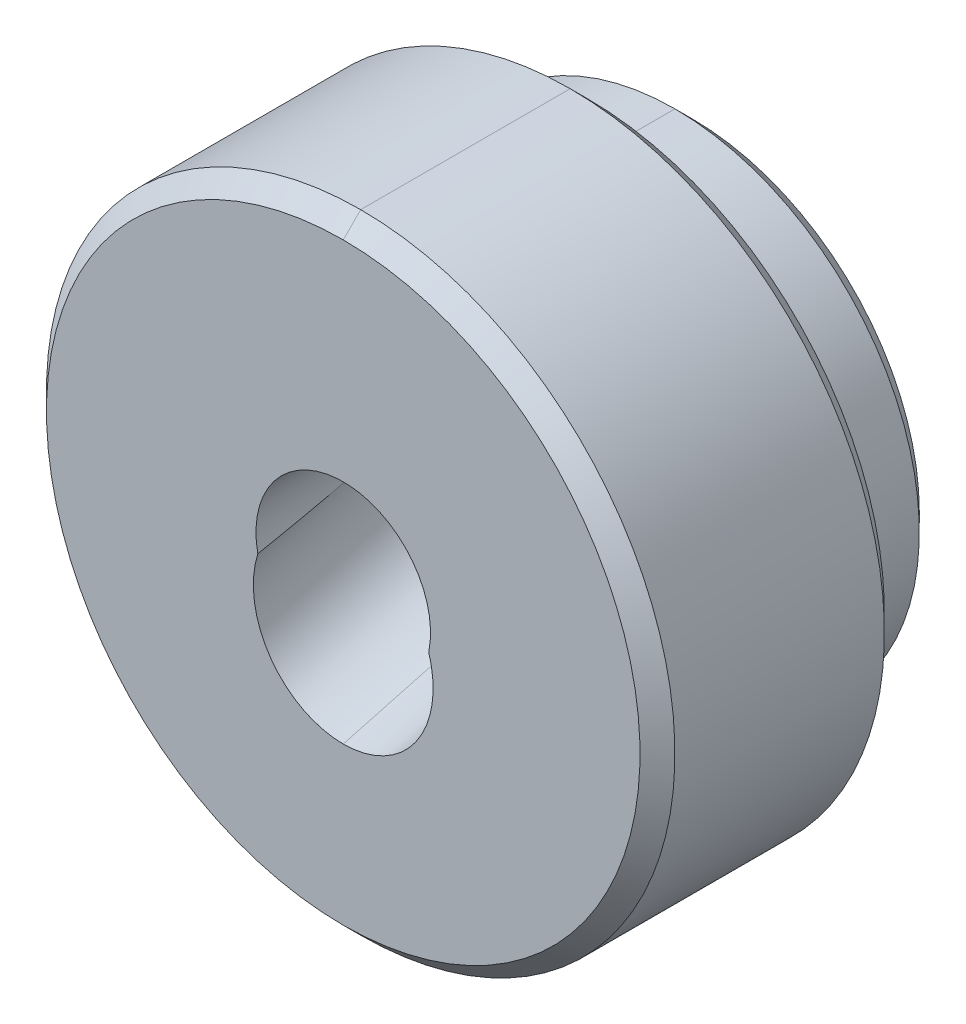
ISO-10303-21;
HEADER;
FILE_DESCRIPTION(('STEP AP214'),'2;1');
FILE_NAME('part.step','',(''),(''),'','','');
FILE_SCHEMA(('AUTOMOTIVE_DESIGN { 1 0 10303 214 1 1 1 1 }'));
ENDSEC;
DATA;
#1=APPLICATION_CONTEXT('core data for automotive mechanical design processes');
#2=APPLICATION_PROTOCOL_DEFINITION('international standard','automotive_design',2000,#1);
#3=PRODUCT_CONTEXT('',#1,'mechanical');
#4=PRODUCT('Part','Part','',(#3));
#5=PRODUCT_RELATED_PRODUCT_CATEGORY('part','',(#4));
#6=PRODUCT_DEFINITION_FORMATION('','',#4);
#7=PRODUCT_DEFINITION_CONTEXT('part definition',#1,'design');
#8=PRODUCT_DEFINITION('design','',#6,#7);
#9=PRODUCT_DEFINITION_SHAPE('','',#8);
#10=(LENGTH_UNIT() NAMED_UNIT(*) SI_UNIT(.MILLI.,.METRE.));
#11=(NAMED_UNIT(*) PLANE_ANGLE_UNIT() SI_UNIT($,.RADIAN.));
#12=(NAMED_UNIT(*) SI_UNIT($,.STERADIAN.) SOLID_ANGLE_UNIT());
#13=UNCERTAINTY_MEASURE_WITH_UNIT(LENGTH_MEASURE(1.E-05),#10,'distance_accuracy_value','');
#14=(GEOMETRIC_REPRESENTATION_CONTEXT(3) GLOBAL_UNCERTAINTY_ASSIGNED_CONTEXT((#13)) GLOBAL_UNIT_ASSIGNED_CONTEXT((#10,
#11,#12)) REPRESENTATION_CONTEXT('',''));
#15=CARTESIAN_POINT('',(0.,0.,0.));
#16=DIRECTION('',(0.,0.,1.));
#17=DIRECTION('',(1.,0.,0.));
#18=AXIS2_PLACEMENT_3D('',#15,#16,#17);
#19=CARTESIAN_POINT('',(0.,0.,5.));
#20=DIRECTION('',(0.,0.,1.));
#21=DIRECTION('',(1.,0.,0.));
#22=AXIS2_PLACEMENT_3D('',#19,#20,#21);
#23=CYLINDRICAL_SURFACE('',#22,14.);
#24=CARTESIAN_POINT('',(0.,0.,5.));
#25=DIRECTION('',(0.,0.,1.));
#26=DIRECTION('',(1.,0.,0.));
#27=AXIS2_PLACEMENT_3D('',#24,#25,#26);
#28=CIRCLE('',#27,14.);
#29=CARTESIAN_POINT('',(-14.,0.,5.));
#30=VERTEX_POINT('',#29);
#31=CARTESIAN_POINT('',(0.,-14.,5.));
#32=VERTEX_POINT('',#31);
#33=EDGE_CURVE('E409',#30,#32,#28,.T.);
#34=ORIENTED_EDGE('',*,*,#33,.F.);
#35=CARTESIAN_POINT('',(0.,0.,5.));
#36=DIRECTION('',(0.,0.,1.));
#37=DIRECTION('',(1.,0.,0.));
#38=AXIS2_PLACEMENT_3D('',#35,#36,#37);
#39=CIRCLE('',#38,14.);
#40=CARTESIAN_POINT('',(0.,14.,5.));
#41=VERTEX_POINT('',#40);
#42=EDGE_CURVE('E278',#41,#30,#39,.T.);
#43=ORIENTED_EDGE('',*,*,#42,.F.);
#44=DIRECTION('',(0.,0.,1.));
#45=VECTOR('',#44,1.);
#46=CARTESIAN_POINT('',(0.,14.,3.));
#47=LINE('',#46,#45);
#48=CARTESIAN_POINT('',(0.,14.,1.));
#49=VERTEX_POINT('',#48);
#50=EDGE_CURVE('E115',#49,#41,#47,.T.);
#51=ORIENTED_EDGE('',*,*,#50,.F.);
#52=CARTESIAN_POINT('',(0.,0.,1.));
#53=DIRECTION('',(0.,0.,-1.));
#54=DIRECTION('',(0.,1.,0.));
#55=AXIS2_PLACEMENT_3D('',#52,#53,#54);
#56=CIRCLE('',#55,14.);
#57=CARTESIAN_POINT('',(0.,-14.,1.));
#58=VERTEX_POINT('',#57);
#59=EDGE_CURVE('E184',#58,#49,#56,.T.);
#60=ORIENTED_EDGE('',*,*,#59,.F.);
#61=DIRECTION('',(0.,0.,-1.));
#62=VECTOR('',#61,1.);
#63=CARTESIAN_POINT('',(0.,-14.,3.));
#64=LINE('',#63,#62);
#65=EDGE_CURVE('E411',#32,#58,#64,.T.);
#66=ORIENTED_EDGE('',*,*,#65,.F.);
#67=EDGE_LOOP('',(#34,#43,#51,#60,#66));
#68=FACE_BOUND('',#67,.T.);
#69=ADVANCED_FACE('F14',(#68),#23,.T.);
#70=CARTESIAN_POINT('',(0.,0.,5.));
#71=DIRECTION('',(0.,0.,1.));
#72=DIRECTION('',(1.,0.,0.));
#73=AXIS2_PLACEMENT_3D('',#70,#71,#72);
#74=CYLINDRICAL_SURFACE('',#73,14.);
#75=ORIENTED_EDGE('',*,*,#65,.T.);
#76=CARTESIAN_POINT('',(0.,0.,1.));
#77=DIRECTION('',(0.,0.,-1.));
#78=DIRECTION('',(0.,1.,0.));
#79=AXIS2_PLACEMENT_3D('',#76,#77,#78);
#80=CIRCLE('',#79,14.);
#81=EDGE_CURVE('E168',#49,#58,#80,.T.);
#82=ORIENTED_EDGE('',*,*,#81,.F.);
#83=ORIENTED_EDGE('',*,*,#50,.T.);
#84=CARTESIAN_POINT('',(0.,0.,5.));
#85=DIRECTION('',(0.,0.,1.));
#86=DIRECTION('',(1.,0.,0.));
#87=AXIS2_PLACEMENT_3D('',#84,#85,#86);
#88=CIRCLE('',#87,14.);
#89=CARTESIAN_POINT('',(14.,0.,5.));
#90=VERTEX_POINT('',#89);
#91=EDGE_CURVE('E276',#90,#41,#88,.T.);
#92=ORIENTED_EDGE('',*,*,#91,.F.);
#93=CARTESIAN_POINT('',(0.,0.,5.));
#94=DIRECTION('',(0.,0.,1.));
#95=DIRECTION('',(1.,0.,0.));
#96=AXIS2_PLACEMENT_3D('',#93,#94,#95);
#97=CIRCLE('',#96,14.);
#98=EDGE_CURVE('E220',#32,#90,#97,.T.);
#99=ORIENTED_EDGE('',*,*,#98,.F.);
#100=EDGE_LOOP('',(#75,#82,#83,#92,#99));
#101=FACE_BOUND('',#100,.T.);
#102=ADVANCED_FACE('F403',(#101),#74,.T.);
#103=CARTESIAN_POINT('',(0.,0.,5.));
#104=DIRECTION('',(0.,0.,1.));
#105=DIRECTION('',(1.,0.,0.));
#106=AXIS2_PLACEMENT_3D('',#103,#104,#105);
#107=TOROIDAL_SURFACE('',#106,15.,1.);
#108=CARTESIAN_POINT('',(15.,0.,5.));
#109=DIRECTION('',(0.,-1.,0.));
#110=DIRECTION('',(-1.,0.,0.));
#111=AXIS2_PLACEMENT_3D('',#108,#109,#110);
#112=CIRCLE('',#111,1.);
#113=CARTESIAN_POINT('',(15.,0.,6.));
#114=VERTEX_POINT('',#113);
#115=EDGE_CURVE('E219',#114,#90,#112,.T.);
#116=ORIENTED_EDGE('',*,*,#115,.F.);
#117=CARTESIAN_POINT('',(0.,0.,6.));
#118=DIRECTION('',(0.,0.,-1.));
#119=DIRECTION('',(1.,0.,0.));
#120=AXIS2_PLACEMENT_3D('',#117,#118,#119);
#121=CIRCLE('',#120,15.);
#122=CARTESIAN_POINT('',(-15.,0.,6.));
#123=VERTEX_POINT('',#122);
#124=EDGE_CURVE('E156',#123,#114,#121,.F.);
#125=ORIENTED_EDGE('',*,*,#124,.F.);
#126=CARTESIAN_POINT('',(-15.,0.,5.));
#127=DIRECTION('',(0.,1.,0.));
#128=DIRECTION('',(1.,0.,0.));
#129=AXIS2_PLACEMENT_3D('',#126,#127,#128);
#130=CIRCLE('',#129,1.);
#131=EDGE_CURVE('E212',#30,#123,#130,.F.);
#132=ORIENTED_EDGE('',*,*,#131,.F.);
#133=ORIENTED_EDGE('',*,*,#33,.T.);
#134=ORIENTED_EDGE('',*,*,#98,.T.);
#135=EDGE_LOOP('',(#116,#125,#132,#133,#134));
#136=FACE_BOUND('',#135,.T.);
#137=ADVANCED_FACE('F197',(#136),#107,.F.);
#138=CARTESIAN_POINT('',(0.,0.,5.));
#139=DIRECTION('',(0.,0.,1.));
#140=DIRECTION('',(1.,0.,0.));
#141=AXIS2_PLACEMENT_3D('',#138,#139,#140);
#142=TOROIDAL_SURFACE('',#141,15.,1.);
#143=ORIENTED_EDGE('',*,*,#91,.T.);
#144=ORIENTED_EDGE('',*,*,#42,.T.);
#145=ORIENTED_EDGE('',*,*,#131,.T.);
#146=CARTESIAN_POINT('',(0.,0.,6.));
#147=DIRECTION('',(0.,0.,-1.));
#148=DIRECTION('',(-1.,0.,0.));
#149=AXIS2_PLACEMENT_3D('',#146,#147,#148);
#150=CIRCLE('',#149,15.);
#151=CARTESIAN_POINT('',(0.,15.,6.));
#152=VERTEX_POINT('',#151);
#153=EDGE_CURVE('E162',#152,#123,#150,.F.);
#154=ORIENTED_EDGE('',*,*,#153,.F.);
#155=CARTESIAN_POINT('',(0.,0.,6.));
#156=DIRECTION('',(0.,0.,-1.));
#157=DIRECTION('',(0.,1.,0.));
#158=AXIS2_PLACEMENT_3D('',#155,#156,#157);
#159=CIRCLE('',#158,15.);
#160=EDGE_CURVE('E151',#114,#152,#159,.F.);
#161=ORIENTED_EDGE('',*,*,#160,.F.);
#162=ORIENTED_EDGE('',*,*,#115,.T.);
#163=EDGE_LOOP('',(#143,#144,#145,#154,#161,#162));
#164=FACE_BOUND('',#163,.T.);
#165=ADVANCED_FACE('F191',(#164),#142,.F.);
#166=CARTESIAN_POINT('',(0.,0.,0.));
#167=DIRECTION('',(0.,0.,1.));
#168=DIRECTION('',(1.,0.,0.));
#169=AXIS2_PLACEMENT_3D('',#166,#167,#168);
#170=CONICAL_SURFACE('',#169,13.,0.785398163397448);
#171=DIRECTION('',(0.,0.707106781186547,-0.707106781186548));
#172=VECTOR('',#171,1.);
#173=CARTESIAN_POINT('',(0.,-9.89949493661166,-3.10050506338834));
#174=LINE('',#173,#172);
#175=CARTESIAN_POINT('',(0.,-13.,0.));
#176=VERTEX_POINT('',#175);
#177=EDGE_CURVE('E165',#58,#176,#174,.T.);
#178=ORIENTED_EDGE('',*,*,#177,.F.);
#179=ORIENTED_EDGE('',*,*,#59,.T.);
#180=DIRECTION('',(0.,0.707106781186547,0.707106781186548));
#181=VECTOR('',#180,1.);
#182=CARTESIAN_POINT('',(0.,9.89949493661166,-3.10050506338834));
#183=LINE('',#182,#181);
#184=CARTESIAN_POINT('',(0.,13.,0.));
#185=VERTEX_POINT('',#184);
#186=EDGE_CURVE('E174',#185,#49,#183,.T.);
#187=ORIENTED_EDGE('',*,*,#186,.F.);
#188=CARTESIAN_POINT('',(0.,0.,0.));
#189=DIRECTION('',(0.,0.,1.));
#190=DIRECTION('',(1.,0.,0.));
#191=AXIS2_PLACEMENT_3D('',#188,#189,#190);
#192=CIRCLE('',#191,13.);
#193=EDGE_CURVE('E148',#176,#185,#192,.F.);
#194=ORIENTED_EDGE('',*,*,#193,.F.);
#195=EDGE_LOOP('',(#178,#179,#187,#194));
#196=FACE_BOUND('',#195,.T.);
#197=ADVANCED_FACE('F196',(#196),#170,.T.);
#198=CARTESIAN_POINT('',(0.,0.,0.));
#199=DIRECTION('',(0.,0.,1.));
#200=DIRECTION('',(1.,0.,0.));
#201=AXIS2_PLACEMENT_3D('',#198,#199,#200);
#202=CONICAL_SURFACE('',#201,13.,0.785398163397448);
#203=ORIENTED_EDGE('',*,*,#177,.T.);
#204=CARTESIAN_POINT('',(0.,0.,0.));
#205=DIRECTION('',(0.,0.,1.));
#206=DIRECTION('',(1.,0.,0.));
#207=AXIS2_PLACEMENT_3D('',#204,#205,#206);
#208=CIRCLE('',#207,13.);
#209=EDGE_CURVE('E145',#185,#176,#208,.F.);
#210=ORIENTED_EDGE('',*,*,#209,.F.);
#211=ORIENTED_EDGE('',*,*,#186,.T.);
#212=ORIENTED_EDGE('',*,*,#81,.T.);
#213=EDGE_LOOP('',(#203,#210,#211,#212));
#214=FACE_BOUND('',#213,.T.);
#215=ADVANCED_FACE('F238',(#214),#202,.T.);
#216=CARTESIAN_POINT('',(17.2040021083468,17.,6.));
#217=DIRECTION('',(0.,0.,-1.));
#218=DIRECTION('',(0.,-1.,0.));
#219=AXIS2_PLACEMENT_3D('',#216,#217,#218);
#220=PLANE('',#219);
#221=ORIENTED_EDGE('',*,*,#124,.T.);
#222=ORIENTED_EDGE('',*,*,#160,.T.);
#223=ORIENTED_EDGE('',*,*,#153,.T.);
#224=EDGE_LOOP('',(#221,#222,#223));
#225=FACE_BOUND('',#224,.T.);
#226=CARTESIAN_POINT('',(0.,0.,6.));
#227=DIRECTION('',(0.,0.,1.));
#228=DIRECTION('',(1.,0.,0.));
#229=AXIS2_PLACEMENT_3D('',#226,#227,#228);
#230=CIRCLE('',#229,17.);
#231=CARTESIAN_POINT('',(0.,17.,6.));
#232=VERTEX_POINT('',#231);
#233=CARTESIAN_POINT('',(0.,-17.,6.));
#234=VERTEX_POINT('',#233);
#235=EDGE_CURVE('E140',#232,#234,#230,.T.);
#236=ORIENTED_EDGE('',*,*,#235,.F.);
#237=CARTESIAN_POINT('',(0.,0.,6.));
#238=DIRECTION('',(0.,0.,1.));
#239=DIRECTION('',(1.,0.,0.));
#240=AXIS2_PLACEMENT_3D('',#237,#238,#239);
#241=CIRCLE('',#240,17.);
#242=EDGE_CURVE('E150',#234,#232,#241,.T.);
#243=ORIENTED_EDGE('',*,*,#242,.F.);
#244=EDGE_LOOP('',(#236,#243));
#245=FACE_BOUND('',#244,.T.);
#246=ADVANCED_FACE('F228',(#225,#245),#220,.T.);
#247=CARTESIAN_POINT('',(0.,0.,6.));
#248=DIRECTION('',(0.,0.,1.));
#249=DIRECTION('',(1.,0.,0.));
#250=AXIS2_PLACEMENT_3D('',#247,#248,#249);
#251=CONICAL_SURFACE('',#250,17.,0.785398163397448);
#252=DIRECTION('',(0.,-0.707106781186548,0.707106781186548));
#253=VECTOR('',#252,1.);
#254=CARTESIAN_POINT('',(0.,-12.7279220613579,1.72792206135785));
#255=LINE('',#254,#253);
#256=CARTESIAN_POINT('',(0.,-18.,7.));
#257=VERTEX_POINT('',#256);
#258=EDGE_CURVE('E143',#234,#257,#255,.T.);
#259=ORIENTED_EDGE('',*,*,#258,.F.);
#260=ORIENTED_EDGE('',*,*,#242,.T.);
#261=DIRECTION('',(0.,-0.707106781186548,-0.707106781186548));
#262=VECTOR('',#261,1.);
#263=CARTESIAN_POINT('',(0.,12.7279220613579,1.72792206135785));
#264=LINE('',#263,#262);
#265=CARTESIAN_POINT('',(0.,18.,7.));
#266=VERTEX_POINT('',#265);
#267=EDGE_CURVE('E144',#266,#232,#264,.T.);
#268=ORIENTED_EDGE('',*,*,#267,.F.);
#269=CARTESIAN_POINT('',(0.,0.,7.));
#270=DIRECTION('',(0.,0.,1.));
#271=DIRECTION('',(0.,1.,0.));
#272=AXIS2_PLACEMENT_3D('',#269,#270,#271);
#273=CIRCLE('',#272,18.);
#274=EDGE_CURVE('E327',#257,#266,#273,.T.);
#275=ORIENTED_EDGE('',*,*,#274,.F.);
#276=EDGE_LOOP('',(#259,#260,#268,#275));
#277=FACE_BOUND('',#276,.T.);
#278=ADVANCED_FACE('F237',(#277),#251,.T.);
#279=CARTESIAN_POINT('',(13.1560021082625,13.,0.));
#280=DIRECTION('',(0.,0.,-1.));
#281=DIRECTION('',(0.,-1.,0.));
#282=AXIS2_PLACEMENT_3D('',#279,#280,#281);
#283=PLANE('',#282);
#284=CARTESIAN_POINT('',(0.,0.,0.));
#285=DIRECTION('',(0.,0.,-1.));
#286=DIRECTION('',(-1.,0.,0.));
#287=AXIS2_PLACEMENT_3D('',#284,#285,#286);
#288=CIRCLE('',#287,5.);
#289=CARTESIAN_POINT('',(4.89458911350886,1.02127244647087,0.));
#290=VERTEX_POINT('',#289);
#291=CARTESIAN_POINT('',(-4.89458911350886,1.02127244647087,0.));
#292=VERTEX_POINT('',#291);
#293=EDGE_CURVE('E28',#290,#292,#288,.T.);
#294=ORIENTED_EDGE('',*,*,#293,.F.);
#295=CARTESIAN_POINT('',(0.,2.67949192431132,0.));
#296=DIRECTION('',(0.,0.,-1.));
#297=DIRECTION('',(0.,-1.,0.));
#298=AXIS2_PLACEMENT_3D('',#295,#296,#297);
#299=ELLIPSE('',#298,5.33167232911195,5.15);
#300=CARTESIAN_POINT('',(0.,8.01116425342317,0.));
#301=VERTEX_POINT('',#300);
#302=EDGE_CURVE('E122',#301,#290,#299,.T.);
#303=ORIENTED_EDGE('',*,*,#302,.F.);
#304=CARTESIAN_POINT('',(0.,2.67949192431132,0.));
#305=DIRECTION('',(0.,0.,-1.));
#306=DIRECTION('',(0.,-1.,0.));
#307=AXIS2_PLACEMENT_3D('',#304,#305,#306);
#308=ELLIPSE('',#307,5.33167232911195,5.15);
#309=EDGE_CURVE('E124',#292,#301,#308,.T.);
#310=ORIENTED_EDGE('',*,*,#309,.F.);
#311=EDGE_LOOP('',(#294,#303,#310));
#312=FACE_BOUND('',#311,.T.);
#313=ORIENTED_EDGE('',*,*,#193,.T.);
#314=ORIENTED_EDGE('',*,*,#209,.T.);
#315=EDGE_LOOP('',(#313,#314));
#316=FACE_BOUND('',#315,.T.);
#317=ADVANCED_FACE('F120',(#312,#316),#283,.T.);
#318=CARTESIAN_POINT('',(0.,0.,6.));
#319=DIRECTION('',(0.,0.,1.));
#320=DIRECTION('',(1.,0.,0.));
#321=AXIS2_PLACEMENT_3D('',#318,#319,#320);
#322=CONICAL_SURFACE('',#321,17.,0.785398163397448);
#323=ORIENTED_EDGE('',*,*,#258,.T.);
#324=CARTESIAN_POINT('',(0.,0.,7.));
#325=DIRECTION('',(0.,0.,1.));
#326=DIRECTION('',(0.,1.,0.));
#327=AXIS2_PLACEMENT_3D('',#324,#325,#326);
#328=CIRCLE('',#327,18.);
#329=EDGE_CURVE('E303',#266,#257,#328,.T.);
#330=ORIENTED_EDGE('',*,*,#329,.F.);
#331=ORIENTED_EDGE('',*,*,#267,.T.);
#332=ORIENTED_EDGE('',*,*,#235,.T.);
#333=EDGE_LOOP('',(#323,#330,#331,#332));
#334=FACE_BOUND('',#333,.T.);
#335=ADVANCED_FACE('F429',(#334),#322,.T.);
#336=CARTESIAN_POINT('',(0.,0.,19.));
#337=DIRECTION('',(0.,0.,1.));
#338=DIRECTION('',(1.,0.,0.));
#339=AXIS2_PLACEMENT_3D('',#336,#337,#338);
#340=CYLINDRICAL_SURFACE('',#339,18.);
#341=DIRECTION('',(0.,0.,1.));
#342=VECTOR('',#341,1.);
#343=CARTESIAN_POINT('',(0.,-18.,13.));
#344=LINE('',#343,#342);
#345=CARTESIAN_POINT('',(0.,-18.,19.));
#346=VERTEX_POINT('',#345);
#347=EDGE_CURVE('E298',#257,#346,#344,.T.);
#348=ORIENTED_EDGE('',*,*,#347,.F.);
#349=ORIENTED_EDGE('',*,*,#274,.T.);
#350=DIRECTION('',(0.,0.,-1.));
#351=VECTOR('',#350,1.);
#352=CARTESIAN_POINT('',(0.,18.,13.));
#353=LINE('',#352,#351);
#354=CARTESIAN_POINT('',(0.,18.,19.));
#355=VERTEX_POINT('',#354);
#356=EDGE_CURVE('E310',#355,#266,#353,.T.);
#357=ORIENTED_EDGE('',*,*,#356,.F.);
#358=CARTESIAN_POINT('',(0.,0.,19.));
#359=DIRECTION('',(0.,0.,1.));
#360=DIRECTION('',(0.,1.,0.));
#361=AXIS2_PLACEMENT_3D('',#358,#359,#360);
#362=CIRCLE('',#361,18.);
#363=EDGE_CURVE('E130',#346,#355,#362,.T.);
#364=ORIENTED_EDGE('',*,*,#363,.F.);
#365=EDGE_LOOP('',(#348,#349,#357,#364));
#366=FACE_BOUND('',#365,.T.);
#367=ADVANCED_FACE('F349',(#366),#340,.T.);
#368=CARTESIAN_POINT('',(0.,0.,20.));
#369=DIRECTION('',(0.,0.,-1.));
#370=DIRECTION('',(-1.,0.,0.));
#371=AXIS2_PLACEMENT_3D('',#368,#369,#370);
#372=CONICAL_SURFACE('',#371,17.,0.785398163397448);
#373=DIRECTION('',(0.,-0.707106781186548,-0.707106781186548));
#374=VECTOR('',#373,1.);
#375=CARTESIAN_POINT('',(0.,-12.7279220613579,24.2720779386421));
#376=LINE('',#375,#374);
#377=CARTESIAN_POINT('',(0.,-17.,20.));
#378=VERTEX_POINT('',#377);
#379=EDGE_CURVE('E135',#378,#346,#376,.T.);
#380=ORIENTED_EDGE('',*,*,#379,.T.);
#381=ORIENTED_EDGE('',*,*,#363,.T.);
#382=DIRECTION('',(0.,-0.707106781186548,0.707106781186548));
#383=VECTOR('',#382,1.);
#384=CARTESIAN_POINT('',(0.,12.7279220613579,24.2720779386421));
#385=LINE('',#384,#383);
#386=CARTESIAN_POINT('',(0.,17.,20.));
#387=VERTEX_POINT('',#386);
#388=EDGE_CURVE('E330',#355,#387,#385,.T.);
#389=ORIENTED_EDGE('',*,*,#388,.T.);
#390=CARTESIAN_POINT('',(0.,0.,20.));
#391=DIRECTION('',(0.,0.,-1.));
#392=DIRECTION('',(-1.,0.,0.));
#393=AXIS2_PLACEMENT_3D('',#390,#391,#392);
#394=CIRCLE('',#393,17.);
#395=EDGE_CURVE('E296',#378,#387,#394,.F.);
#396=ORIENTED_EDGE('',*,*,#395,.F.);
#397=EDGE_LOOP('',(#380,#381,#389,#396));
#398=FACE_BOUND('',#397,.T.);
#399=ADVANCED_FACE('F350',(#398),#372,.T.);
#400=CARTESIAN_POINT('',(0.,3.03672654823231,-1.33321776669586));
#401=DIRECTION('',(0.,-0.25881904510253,0.965925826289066));
#402=DIRECTION('',(0.,-0.965925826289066,-0.25881904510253));
#403=AXIS2_PLACEMENT_3D('',#400,#401,#402);
#404=CYLINDRICAL_SURFACE('',#403,5.15);
#405=CARTESIAN_POINT('',(0.,5.,11.2378179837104));
#406=CARTESIAN_POINT('',(0.140627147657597,5.0000151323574,11.2378283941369));
#407=CARTESIAN_POINT('',(0.281252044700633,4.99406783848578,11.2377050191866));
#408=CARTESIAN_POINT('',(0.561495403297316,4.97035772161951,11.2372645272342));
#409=CARTESIAN_POINT('',(0.701113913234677,4.95259547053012,11.2369474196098));
#410=CARTESIAN_POINT('',(0.978185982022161,4.90539376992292,11.2361937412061));
#411=CARTESIAN_POINT('',(1.11564199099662,4.87596870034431,11.2357573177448));
#412=CARTESIAN_POINT('',(1.38758785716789,4.80565514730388,11.2349171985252));
#413=CARTESIAN_POINT('',(1.52207775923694,4.76476683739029,11.2345135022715));
#414=CARTESIAN_POINT('',(1.78718507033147,4.67179925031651,11.2339605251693));
#415=CARTESIAN_POINT('',(1.91780113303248,4.61971613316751,11.2338113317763));
#416=CARTESIAN_POINT('',(2.17418689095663,4.50473639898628,11.2340812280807));
#417=CARTESIAN_POINT('',(2.29995648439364,4.44183955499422,11.2345003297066));
#418=CARTESIAN_POINT('',(2.54584455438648,4.30562935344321,11.2363374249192));
#419=CARTESIAN_POINT('',(2.66595855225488,4.23230791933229,11.2377561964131));
#420=CARTESIAN_POINT('',(2.89955704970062,4.07582280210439,11.2421813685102));
#421=CARTESIAN_POINT('',(3.0130419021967,3.9926596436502,11.2451876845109));
#422=CARTESIAN_POINT('',(3.23239473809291,3.81723928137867,11.2535891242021));
#423=CARTESIAN_POINT('',(3.33827346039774,3.72499535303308,11.2589807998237));
#424=CARTESIAN_POINT('',(3.54177398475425,3.53206652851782,11.2732674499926));
#425=CARTESIAN_POINT('',(3.63939662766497,3.4313824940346,11.2821620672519));
#426=CARTESIAN_POINT('',(3.82549117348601,3.22259753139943,11.3050155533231));
#427=CARTESIAN_POINT('',(3.91397376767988,3.11450552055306,11.3189684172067));
#428=CARTESIAN_POINT('',(4.08103191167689,2.89214780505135,11.3541453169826));
#429=CARTESIAN_POINT('',(4.15961493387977,2.7778868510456,11.3753638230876));
#430=CARTESIAN_POINT('',(4.31413676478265,2.53207884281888,11.431101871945));
#431=CARTESIAN_POINT('',(4.38885153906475,2.40000597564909,11.4668200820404));
#432=CARTESIAN_POINT('',(4.4900149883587,2.20121027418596,11.5340931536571));
#433=CARTESIAN_POINT('',(4.52189546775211,2.13488749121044,11.5587732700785));
#434=CARTESIAN_POINT('',(4.58195777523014,2.00272729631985,11.613450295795));
#435=CARTESIAN_POINT('',(4.61013956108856,1.93688988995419,11.6434472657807));
#436=CARTESIAN_POINT('',(4.66311198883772,1.80567699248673,11.7098770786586));
#437=CARTESIAN_POINT('',(4.68784494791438,1.74032351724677,11.7464003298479));
#438=CARTESIAN_POINT('',(4.73342454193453,1.61223986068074,11.8258476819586));
#439=CARTESIAN_POINT('',(4.75427188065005,1.54950920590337,11.8687706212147));
#440=CARTESIAN_POINT('',(4.81116454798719,1.36707094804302,12.0070810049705));
#441=CARTESIAN_POINT('',(4.84169663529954,1.25276549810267,12.1121810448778));
#442=CARTESIAN_POINT('',(4.88015337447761,1.08984036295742,12.2912025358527));
#443=CARTESIAN_POINT('',(4.89211205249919,1.03446673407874,12.3584631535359));
#444=CARTESIAN_POINT('',(4.91314540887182,0.929439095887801,12.4977769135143));
#445=CARTESIAN_POINT('',(4.9222192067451,0.879786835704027,12.5698315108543));
#446=CARTESIAN_POINT('',(4.93814629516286,0.785503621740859,12.7178949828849));
#447=CARTESIAN_POINT('',(4.94498721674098,0.740901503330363,12.7939232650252));
#448=CARTESIAN_POINT('',(4.95692119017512,0.656313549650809,12.9485943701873));
#449=CARTESIAN_POINT('',(4.96201455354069,0.616326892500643,13.0272367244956));
#450=CARTESIAN_POINT('',(4.97382171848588,0.514969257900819,13.2392918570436));
#451=CARTESIAN_POINT('',(4.97936599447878,0.457028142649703,13.3744005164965));
#452=CARTESIAN_POINT('',(4.98809277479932,0.349052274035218,13.6478492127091));
#453=CARTESIAN_POINT('',(4.99127338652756,0.299023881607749,13.7861917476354));
#454=CARTESIAN_POINT('',(4.99602971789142,0.204738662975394,14.0651943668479));
#455=CARTESIAN_POINT('',(4.99760167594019,0.160495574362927,14.2058591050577));
#456=CARTESIAN_POINT('',(4.99959083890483,0.0764470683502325,14.4885255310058));
#457=CARTESIAN_POINT('',(5.00000783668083,0.0366424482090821,14.6305274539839));
#458=CARTESIAN_POINT('',(4.99998354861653,-0.0782931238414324,15.0598756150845));
#459=CARTESIAN_POINT('',(4.9982430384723,-0.148313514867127,15.3485810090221));
#460=CARTESIAN_POINT('',(4.99257936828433,-0.280017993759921,15.92734964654));
#461=CARTESIAN_POINT('',(4.98865944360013,-0.341714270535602,16.2174102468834));
#462=CARTESIAN_POINT('',(4.97835022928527,-0.469967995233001,16.8490796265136));
#463=CARTESIAN_POINT('',(4.97165023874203,-0.535507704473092,17.1908887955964));
#464=CARTESIAN_POINT('',(4.95640912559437,-0.661838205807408,17.8755151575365));
#465=CARTESIAN_POINT('',(4.94786703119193,-0.722626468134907,18.2183327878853));
#466=CARTESIAN_POINT('',(4.92933264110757,-0.839720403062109,18.8974335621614));
#467=CARTESIAN_POINT('',(4.91937375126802,-0.896092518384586,19.2337062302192));
#468=CARTESIAN_POINT('',(4.89796648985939,-1.00649273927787,19.906370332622));
#469=CARTESIAN_POINT('',(4.88651906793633,-1.06052231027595,20.2427615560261));
#470=CARTESIAN_POINT('',(4.87436413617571,-1.11381069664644,20.5792380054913));
#471=B_SPLINE_CURVE_WITH_KNOTS('',3,(#405,#406,#407,#408,#409,#410,#411,#412,#413,#414,#415,
#416,#417,#418,#419,#420,#421,#422,#423,#424,#425,#426,#427,#428,#429,#430,#431,#432,#433,#434,
#435,#436,#437,#438,#439,#440,#441,#442,#443,#444,#445,#446,#447,#448,#449,#450,#451,#452,#453,
#454,#455,#456,#457,#458,#459,#460,#461,#462,#463,#464,#465,#466,#467,#468,#469,#470),
.UNSPECIFIED.,.F.,.F.,(4,2,2,2,2,2,2,2,2,2,2,2,2,2,2,2,2,2,2,2,2,2,2,2,2,2,2,2,2,2,2,2,4),(0.,
0.421752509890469,0.843484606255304,1.2646983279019,1.68590567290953,2.10725772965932,
2.52861863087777,2.95030778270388,3.37197446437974,3.79303360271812,4.21404980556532,
4.63456782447,5.05476650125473,5.52081292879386,5.75343971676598,5.98606916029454,
6.22221409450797,6.45831621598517,6.92930271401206,7.19280920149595,7.45639603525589,
7.72141915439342,7.98639500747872,8.42730725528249,8.86857216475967,9.31086656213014,
9.7532402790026,10.6442248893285,11.5338903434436,12.5781252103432,13.6229123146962,
14.6462308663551,15.6688997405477),.UNSPECIFIED.);
#472=CARTESIAN_POINT('',(0.,5.,11.2378179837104));
#473=VERTEX_POINT('',#472);
#474=CARTESIAN_POINT('',(4.89458911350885,-1.02127244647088,20.));
#475=VERTEX_POINT('',#474);
#476=EDGE_CURVE('E35',#473,#475,#471,.T.);
#477=ORIENTED_EDGE('',*,*,#476,.F.);
#478=DIRECTION('',(0.,-0.258819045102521,0.965925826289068));
#479=VECTOR('',#478,1.);
#480=CARTESIAN_POINT('',(0.,4.9745180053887,11.332918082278));
#481=LINE('',#480,#479);
#482=EDGE_CURVE('E129',#301,#473,#481,.T.);
#483=ORIENTED_EDGE('',*,*,#482,.F.);
#484=ORIENTED_EDGE('',*,*,#302,.T.);
#485=CARTESIAN_POINT('',(0.,-5.,8.76218201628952));
#486=CARTESIAN_POINT('',(0.140627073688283,-5.00001513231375,8.76217160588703));
#487=CARTESIAN_POINT('',(0.281251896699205,-4.99406784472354,8.76229498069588));
#488=CARTESIAN_POINT('',(0.561495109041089,-4.97035775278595,8.7627354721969));
#489=CARTESIAN_POINT('',(0.701113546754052,-4.95259552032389,8.76305257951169));
#490=CARTESIAN_POINT('',(0.978185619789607,-4.90539384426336,8.76380625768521));
#491=CARTESIAN_POINT('',(1.11564170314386,-4.87596876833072,8.76424268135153));
#492=CARTESIAN_POINT('',(1.3875877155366,-4.8056551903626,8.76508280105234));
#493=CARTESIAN_POINT('',(1.52207768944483,-4.76476686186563,8.76548649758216));
#494=CARTESIAN_POINT('',(1.78718518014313,-4.67179921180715,8.76603947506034));
#495=CARTESIAN_POINT('',(1.91780134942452,-4.6197160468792,8.76618866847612));
#496=CARTESIAN_POINT('',(2.17418731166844,-4.50473619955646,8.76591877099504));
#497=CARTESIAN_POINT('',(2.29995700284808,-4.44183929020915,8.76549966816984));
#498=CARTESIAN_POINT('',(2.54584505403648,-4.30562905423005,8.76366256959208));
#499=CARTESIAN_POINT('',(2.6659589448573,-4.23230766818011,8.76224379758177));
#500=CARTESIAN_POINT('',(2.89955723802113,-4.07582266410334,8.75781862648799));
#501=CARTESIAN_POINT('',(3.01304199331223,-3.99265957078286,8.7548123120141));
#502=CARTESIAN_POINT('',(3.23239441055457,-3.81723954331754,8.74641088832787));
#503=CARTESIAN_POINT('',(3.33827282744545,-3.72499590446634,8.74101923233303));
#504=CARTESIAN_POINT('',(3.54177279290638,-3.53206770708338,8.72673264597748));
#505=CARTESIAN_POINT('',(3.63939518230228,-3.43138401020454,8.71783807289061));
#506=CARTESIAN_POINT('',(3.82548983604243,-3.22259913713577,8.69498464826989));
#507=CARTESIAN_POINT('',(3.91397273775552,-3.1145068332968,8.68103177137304));
#508=CARTESIAN_POINT('',(4.08103144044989,-2.8921484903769,8.64585481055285));
#509=CARTESIAN_POINT('',(4.15961471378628,-2.77788720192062,8.62463625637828));
#510=CARTESIAN_POINT('',(4.31413746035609,-2.53207773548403,8.56889787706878));
#511=CARTESIAN_POINT('',(4.38885281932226,-2.40000370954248,8.53317930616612));
#512=CARTESIAN_POINT('',(4.49001637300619,-2.20120742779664,8.46590580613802));
#513=CARTESIAN_POINT('',(4.52189653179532,-2.1348852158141,8.44122583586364));
#514=CARTESIAN_POINT('',(4.58195825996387,-2.00272616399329,8.38654918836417));
#515=CARTESIAN_POINT('',(4.61013978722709,-1.93688932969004,8.35655245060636));
#516=CARTESIAN_POINT('',(4.66311145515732,-1.80567831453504,8.29012359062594));
#517=CARTESIAN_POINT('',(4.68784395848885,-1.7403261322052,8.25360113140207));
#518=CARTESIAN_POINT('',(4.73342279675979,-1.61224493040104,8.17415562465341));
#519=CARTESIAN_POINT('',(4.75426983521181,-1.54951543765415,8.13123373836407));
#520=CARTESIAN_POINT('',(4.81116331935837,-1.36707553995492,7.99292318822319));
#521=CARTESIAN_POINT('',(4.84169614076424,-1.25276758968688,7.88782124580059));
#522=CARTESIAN_POINT('',(4.88015368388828,-1.08983905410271,7.70879603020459));
#523=CARTESIAN_POINT('',(4.89211258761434,-1.03446425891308,7.64153384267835));
#524=CARTESIAN_POINT('',(4.91314628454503,-0.929434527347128,7.50221674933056));
#525=CARTESIAN_POINT('',(4.92222019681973,-0.879781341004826,7.4301603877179));
#526=CARTESIAN_POINT('',(4.93814708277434,-0.785498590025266,7.28209658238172));
#527=CARTESIAN_POINT('',(4.94498778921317,-0.740897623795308,7.20606989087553));
#528=CARTESIAN_POINT('',(4.95692141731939,-0.656311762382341,7.05140211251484));
#529=CARTESIAN_POINT('',(4.96201465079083,-0.616326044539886,6.97276149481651));
#530=CARTESIAN_POINT('',(4.97382328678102,-0.514955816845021,6.76068003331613));
#531=CARTESIAN_POINT('',(4.97936836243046,-0.457003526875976,6.62554214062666));
#532=CARTESIAN_POINT('',(4.98809596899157,-0.349008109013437,6.35203394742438));
#533=CARTESIAN_POINT('',(4.9912766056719,-0.298971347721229,6.21366114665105));
#534=CARTESIAN_POINT('',(4.99603254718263,-0.204671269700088,5.93459783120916));
#535=CARTESIAN_POINT('',(4.9976040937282,-0.160421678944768,5.79390266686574));
#536=CARTESIAN_POINT('',(4.99959220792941,-0.0763611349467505,5.51117520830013));
#537=CARTESIAN_POINT('',(5.00000856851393,-0.0365509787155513,5.36914267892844));
#538=CARTESIAN_POINT('',(4.99998199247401,0.0783665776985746,4.93982580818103));
#539=CARTESIAN_POINT('',(4.99824093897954,0.148367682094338,4.65118361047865));
#540=CARTESIAN_POINT('',(4.99257805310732,0.280043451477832,4.07253594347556));
#541=CARTESIAN_POINT('',(4.98865940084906,0.341730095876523,3.78253307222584));
#542=CARTESIAN_POINT('',(4.97914621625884,0.460049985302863,3.19974671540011));
#543=CARTESIAN_POINT('',(4.97354191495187,0.516651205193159,2.90695692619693));
#544=CARTESIAN_POINT('',(4.96094569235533,0.626133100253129,2.32057697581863));
#545=CARTESIAN_POINT('',(4.95395311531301,0.679012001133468,2.02698650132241));
#546=CARTESIAN_POINT('',(4.93886374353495,0.781184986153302,1.44457183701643));
#547=CARTESIAN_POINT('',(4.9307886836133,0.830525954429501,1.15575526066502));
#548=CARTESIAN_POINT('',(4.91351503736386,0.927223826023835,0.577987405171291));
#549=CARTESIAN_POINT('',(4.90431707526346,0.974581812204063,0.289036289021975));
#550=CARTESIAN_POINT('',(4.89458911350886,1.02127244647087,0.));
#551=B_SPLINE_CURVE_WITH_KNOTS('',3,(#485,#486,#487,#488,#489,#490,#491,#492,#493,#494,#495,
#496,#497,#498,#499,#500,#501,#502,#503,#504,#505,#506,#507,#508,#509,#510,#511,#512,#513,#514,
#515,#516,#517,#518,#519,#520,#521,#522,#523,#524,#525,#526,#527,#528,#529,#530,#531,#532,#533,
#534,#535,#536,#537,#538,#539,#540,#541,#542,#543,#544,#545,#546,#547,#548,#549,#550),
.UNSPECIFIED.,.F.,.F.,(4,2,2,2,2,2,2,2,2,2,2,2,2,2,2,2,2,2,2,2,2,2,2,2,2,2,2,2,2,2,2,2,4),(0.,
0.421752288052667,0.843484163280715,1.26469810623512,1.68590567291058,2.10725807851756,
2.52861932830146,2.95030813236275,3.37197446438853,3.79303234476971,4.21404729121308,
4.63456656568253,5.05476650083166,5.52081691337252,5.75344170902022,5.98606915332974,
6.2222093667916,6.45830678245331,6.92930267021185,7.19281503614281,7.45640778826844,
7.7214250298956,7.98639495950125,8.42740078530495,8.86875953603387,9.31114681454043,
9.75361338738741,10.6444005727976,11.533890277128,12.4286376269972,13.3238086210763,
14.2031354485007,15.081975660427),.UNSPECIFIED.);
#552=CARTESIAN_POINT('',(0.,-5.,8.76218201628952));
#553=VERTEX_POINT('',#552);
#554=EDGE_CURVE('E108',#553,#290,#551,.T.);
#555=ORIENTED_EDGE('',*,*,#554,.F.);
#556=DIRECTION('',(0.,0.258819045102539,-0.965925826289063));
#557=VECTOR('',#556,1.);
#558=CARTESIAN_POINT('',(0.,-4.9745180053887,8.66708191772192));
#559=LINE('',#558,#557);
#560=CARTESIAN_POINT('',(0.,-8.01116425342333,20.));
#561=VERTEX_POINT('',#560);
#562=EDGE_CURVE('E132',#561,#553,#559,.T.);
#563=ORIENTED_EDGE('',*,*,#562,.F.);
#564=CARTESIAN_POINT('',(0.,-2.67949192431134,20.));
#565=DIRECTION('',(0.,0.,1.));
#566=DIRECTION('',(0.,-1.,0.));
#567=AXIS2_PLACEMENT_3D('',#564,#565,#566);
#568=ELLIPSE('',#567,5.33167232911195,5.15);
#569=EDGE_CURVE('E295',#475,#561,#568,.F.);
#570=ORIENTED_EDGE('',*,*,#569,.F.);
#571=EDGE_LOOP('',(#477,#483,#484,#555,#563,#570));
#572=FACE_BOUND('',#571,.T.);
#573=ADVANCED_FACE('F127',(#572),#404,.F.);
#574=CARTESIAN_POINT('',(0.,3.03672654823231,-1.33321776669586));
#575=DIRECTION('',(0.,-0.25881904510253,0.965925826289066));
#576=DIRECTION('',(0.,-0.965925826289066,-0.25881904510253));
#577=AXIS2_PLACEMENT_3D('',#574,#575,#576);
#578=CYLINDRICAL_SURFACE('',#577,5.15);
#579=CARTESIAN_POINT('',(-4.87436413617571,-1.11381069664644,20.5792380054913));
#580=CARTESIAN_POINT('',(-4.88177242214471,-1.08138249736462,20.3742878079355));
#581=CARTESIAN_POINT('',(-4.888913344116,-1.04864996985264,20.1693757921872));
#582=CARTESIAN_POINT('',(-4.9026496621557,-0.982431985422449,19.7596516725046));
#583=CARTESIAN_POINT('',(-4.9092450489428,-0.948946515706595,19.5548395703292));
#584=CARTESIAN_POINT('',(-4.92820430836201,-0.847103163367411,18.940340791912));
#585=CARTESIAN_POINT('',(-4.93973191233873,-0.777398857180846,18.5308500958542));
#586=CARTESIAN_POINT('',(-4.96043947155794,-0.632071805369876,17.7097678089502));
#587=CARTESIAN_POINT('',(-4.96960174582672,-0.556409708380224,17.2981825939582));
#588=CARTESIAN_POINT('',(-4.98110232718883,-0.436140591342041,16.6821369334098));
#589=CARTESIAN_POINT('',(-4.98456174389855,-0.394927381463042,16.4770371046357));
#590=CARTESIAN_POINT('',(-4.99059838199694,-0.309473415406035,16.0674586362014));
#591=CARTESIAN_POINT('',(-4.99317563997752,-0.265232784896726,15.862979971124));
#592=CARTESIAN_POINT('',(-4.99685195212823,-0.181338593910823,15.4932657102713));
#593=CARTESIAN_POINT('',(-4.99813774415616,-0.142384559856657,15.3278740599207));
#594=CARTESIAN_POINT('',(-4.99979569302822,-0.060905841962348,14.9979313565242));
#595=CARTESIAN_POINT('',(-5.00016770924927,-0.0183806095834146,14.8333804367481));
#596=CARTESIAN_POINT('',(-4.99969142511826,0.0714587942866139,14.5055524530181));
#597=CARTESIAN_POINT('',(-4.99884292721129,0.11877373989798,14.3422755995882));
#598=CARTESIAN_POINT('',(-4.99541851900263,0.21995643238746,14.0177852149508));
#599=CARTESIAN_POINT('',(-4.99284313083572,0.27382219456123,13.8565710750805));
#600=CARTESIAN_POINT('',(-4.98659448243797,0.367572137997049,13.6009229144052));
#601=CARTESIAN_POINT('',(-4.98376343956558,0.404513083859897,13.5053949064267));
#602=CARTESIAN_POINT('',(-4.97681378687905,0.482561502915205,13.3161139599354));
#603=CARTESIAN_POINT('',(-4.97269549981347,0.523667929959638,13.2223605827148));
#604=CARTESIAN_POINT('',(-4.96272658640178,0.610963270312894,13.0374769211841));
#605=CARTESIAN_POINT('',(-4.95687852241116,0.657144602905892,12.946342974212));
#606=CARTESIAN_POINT('',(-4.94281125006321,0.755704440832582,12.7677146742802));
#607=CARTESIAN_POINT('',(-4.93459319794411,0.808079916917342,12.680218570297));
#608=CARTESIAN_POINT('',(-4.91117853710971,0.941570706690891,12.477924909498));
#609=CARTESIAN_POINT('',(-4.89451610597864,1.0260340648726,12.3654228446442));
#610=CARTESIAN_POINT('',(-4.85221679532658,1.21030182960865,12.1559230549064));
#611=CARTESIAN_POINT('',(-4.82660545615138,1.31006212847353,12.0588823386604));
#612=CARTESIAN_POINT('',(-4.76363181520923,1.52319542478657,11.8843720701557));
#613=CARTESIAN_POINT('',(-4.72620809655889,1.63663760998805,11.8070087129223));
#614=CARTESIAN_POINT('',(-4.63850883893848,1.87079401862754,11.6729501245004));
#615=CARTESIAN_POINT('',(-4.58819906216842,1.99152694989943,11.6163109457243));
#616=CARTESIAN_POINT('',(-4.49363770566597,2.19440868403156,11.536010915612));
#617=CARTESIAN_POINT('',(-4.45272993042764,2.2763467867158,11.5076144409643));
#618=CARTESIAN_POINT('',(-4.36554143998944,2.43938115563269,11.4572775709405));
#619=CARTESIAN_POINT('',(-4.31925859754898,2.52047707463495,11.4353397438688));
#620=CARTESIAN_POINT('',(-4.2215314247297,2.68095598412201,11.3966108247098));
#621=CARTESIAN_POINT('',(-4.17007732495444,2.76033537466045,11.3798297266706));
#622=CARTESIAN_POINT('',(-4.06235295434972,2.91655564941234,11.3503575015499));
#623=CARTESIAN_POINT('',(-4.0060813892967,2.99339584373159,11.3376674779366));
#624=CARTESIAN_POINT('',(-3.86668811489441,3.17270625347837,11.3112536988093));
#625=CARTESIAN_POINT('',(-3.78150279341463,3.27379171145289,11.298977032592));
#626=CARTESIAN_POINT('',(-3.6031429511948,3.4691310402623,11.2787219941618));
#627=CARTESIAN_POINT('',(-3.50996595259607,3.56338277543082,11.2707449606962));
#628=CARTESIAN_POINT('',(-3.31635178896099,3.74424242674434,11.2578248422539));
#629=CARTESIAN_POINT('',(-3.21591772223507,3.83085357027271,11.2528804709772));
#630=CARTESIAN_POINT('',(-3.00840258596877,3.99588500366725,11.2450958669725));
#631=CARTESIAN_POINT('',(-2.90131914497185,4.07430234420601,11.242256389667));
#632=CARTESIAN_POINT('',(-2.68006399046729,4.22317704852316,11.2379844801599));
#633=CARTESIAN_POINT('',(-2.56582887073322,4.29354062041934,11.2365673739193));
#634=CARTESIAN_POINT('',(-2.33202952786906,4.42488716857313,11.2346754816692));
#635=CARTESIAN_POINT('',(-2.21246339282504,4.48586674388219,11.2342010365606));
#636=CARTESIAN_POINT('',(-1.96887786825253,4.59798625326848,11.2338100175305));
#637=CARTESIAN_POINT('',(-1.84486109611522,4.64913186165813,11.2338931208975));
#638=CARTESIAN_POINT('',(-1.5931163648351,4.74130534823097,11.2343337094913));
#639=CARTESIAN_POINT('',(-1.46538734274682,4.78233029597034,11.2346912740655));
#640=CARTESIAN_POINT('',(-1.1189201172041,4.87839511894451,11.2357306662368));
#641=CARTESIAN_POINT('',(-0.897438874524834,4.92395415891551,11.236467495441));
#642=CARTESIAN_POINT('',(-0.562397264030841,4.96955324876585,11.2372521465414));
#643=CARTESIAN_POINT('',(-0.450244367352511,4.98096303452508,11.2374602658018));
#644=CARTESIAN_POINT('',(-0.22540952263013,4.99618544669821,11.2377444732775));
#645=CARTESIAN_POINT('',(-0.112727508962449,4.99999710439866,11.2378205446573));
#646=CARTESIAN_POINT('',(0.,5.,11.2378179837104));
#647=B_SPLINE_CURVE_WITH_KNOTS('',3,(#579,#580,#581,#582,#583,#584,#585,#586,#587,#588,#589,
#590,#591,#592,#593,#594,#595,#596,#597,#598,#599,#600,#601,#602,#603,#604,#605,#606,#607,#608,
#609,#610,#611,#612,#613,#614,#615,#616,#617,#618,#619,#620,#621,#622,#623,#624,#625,#626,#627,
#628,#629,#630,#631,#632,#633,#634,#635,#636,#637,#638,#639,#640,#641,#642,#643,#644,#645,#646),
.UNSPECIFIED.,.F.,.F.,(4,2,2,2,2,2,2,2,2,2,2,2,2,2,2,2,2,2,2,2,2,2,2,2,2,2,2,2,2,2,2,2,2,4),(0.,
0.622895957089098,1.24580250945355,2.49240090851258,3.74806420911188,4.37573194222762,
5.00337363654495,5.51310966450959,6.02292413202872,6.53282112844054,7.04256402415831,
7.34986474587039,7.65708848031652,7.96385937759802,8.27048086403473,8.69389649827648,
9.11611343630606,9.54056283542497,9.9661518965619,10.2534445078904,10.5408512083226,
10.8288114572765,11.116849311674,11.514591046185,11.9124565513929,12.310153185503,
12.7079924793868,13.1100738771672,13.5123006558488,13.9142946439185,14.3164048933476,
14.9923448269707,15.3303290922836,15.6683564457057),.UNSPECIFIED.);
#648=CARTESIAN_POINT('',(-4.89458911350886,-1.02127244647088,20.));
#649=VERTEX_POINT('',#648);
#650=EDGE_CURVE('E125',#649,#473,#647,.T.);
#651=ORIENTED_EDGE('',*,*,#650,.F.);
#652=CARTESIAN_POINT('',(0.,-2.67949192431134,20.));
#653=DIRECTION('',(0.,0.,1.));
#654=DIRECTION('',(0.,-1.,0.));
#655=AXIS2_PLACEMENT_3D('',#652,#653,#654);
#656=ELLIPSE('',#655,5.33167232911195,5.15);
#657=EDGE_CURVE('E292',#561,#649,#656,.F.);
#658=ORIENTED_EDGE('',*,*,#657,.F.);
#659=ORIENTED_EDGE('',*,*,#562,.T.);
#660=CARTESIAN_POINT('',(-4.89458911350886,1.02127244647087,0.));
#661=CARTESIAN_POINT('',(-4.9010953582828,0.99008225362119,0.19321330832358));
#662=CARTESIAN_POINT('',(-4.90736098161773,0.958571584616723,0.386383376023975));
#663=CARTESIAN_POINT('',(-4.9193969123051,0.894757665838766,0.77261207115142));
#664=CARTESIAN_POINT('',(-4.92516720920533,0.862454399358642,0.965670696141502));
#665=CARTESIAN_POINT('',(-4.94172212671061,0.764079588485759,1.54492799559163));
#666=CARTESIAN_POINT('',(-4.95174067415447,0.696590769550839,1.93090939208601));
#667=CARTESIAN_POINT('',(-4.96958870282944,0.555297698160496,2.70545987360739));
#668=CARTESIAN_POINT('',(-4.97739719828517,0.481441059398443,3.09402009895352));
#669=CARTESIAN_POINT('',(-4.98692149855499,0.363517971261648,3.6753900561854));
#670=CARTESIAN_POINT('',(-4.98973125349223,0.323027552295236,3.86890450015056));
#671=CARTESIAN_POINT('',(-4.99447028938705,0.238861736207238,4.25524733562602));
#672=CARTESIAN_POINT('',(-4.99639961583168,0.195186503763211,4.44807576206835));
#673=CARTESIAN_POINT('',(-4.99887053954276,0.112476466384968,4.79514124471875));
#674=CARTESIAN_POINT('',(-4.99960962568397,0.0742023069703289,4.94955719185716));
#675=CARTESIAN_POINT('',(-5.00015784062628,-0.00600683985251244,5.25747575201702));
#676=CARTESIAN_POINT('',(-4.99996681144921,-0.0479424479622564,5.41097820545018));
#677=CARTESIAN_POINT('',(-4.9983288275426,-0.136676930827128,5.71656766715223));
#678=CARTESIAN_POINT('',(-4.99688194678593,-0.183475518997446,5.86865475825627));
#679=CARTESIAN_POINT('',(-4.99220080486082,-0.283670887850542,6.17061198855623));
#680=CARTESIAN_POINT('',(-4.98896713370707,-0.337065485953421,6.32048284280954));
#681=CARTESIAN_POINT('',(-4.98158121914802,-0.430207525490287,6.55833472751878));
#682=CARTESIAN_POINT('',(-4.97829071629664,-0.467060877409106,6.64746996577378));
#683=CARTESIAN_POINT('',(-4.97037518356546,-0.544891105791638,6.82385089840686));
#684=CARTESIAN_POINT('',(-4.96575051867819,-0.585866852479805,6.91109710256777));
#685=CARTESIAN_POINT('',(-4.95472753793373,-0.672749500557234,7.08281751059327));
#686=CARTESIAN_POINT('',(-4.94833252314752,-0.718647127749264,7.16729654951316));
#687=CARTESIAN_POINT('',(-4.93315717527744,-0.816332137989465,7.33252122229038));
#688=CARTESIAN_POINT('',(-4.92437792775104,-0.868116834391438,7.41326853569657));
#689=CARTESIAN_POINT('',(-4.89910220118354,-1.00267670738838,7.60392571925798));
#690=CARTESIAN_POINT('',(-4.88090983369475,-1.08909727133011,7.71113567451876));
#691=CARTESIAN_POINT('',(-4.83524592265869,-1.27655649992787,7.90943555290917));
#692=CARTESIAN_POINT('',(-4.80779601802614,-1.37756076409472,8.00056231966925));
#693=CARTESIAN_POINT('',(-4.74132316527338,-1.5913317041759,8.16323717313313));
#694=CARTESIAN_POINT('',(-4.70226990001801,-1.7041286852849,8.23473301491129));
#695=CARTESIAN_POINT('',(-4.61187053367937,-1.93548503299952,8.35839029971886));
#696=CARTESIAN_POINT('',(-4.56049147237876,-2.05405915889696,8.4104989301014));
#697=CARTESIAN_POINT('',(-4.46252699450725,-2.25714903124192,8.48613230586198));
#698=CARTESIAN_POINT('',(-4.4188022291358,-2.34166666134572,8.51356825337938));
#699=CARTESIAN_POINT('',(-4.3257035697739,-2.50947942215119,8.56195202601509));
#700=CARTESIAN_POINT('',(-4.27632713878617,-2.59277398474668,8.58289692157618));
#701=CARTESIAN_POINT('',(-4.1721677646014,-2.75726656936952,8.61968152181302));
#702=CARTESIAN_POINT('',(-4.1173751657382,-2.83846050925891,8.63551188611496));
#703=CARTESIAN_POINT('',(-4.00275358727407,-2.99793469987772,8.66316144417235));
#704=CARTESIAN_POINT('',(-3.94292332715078,-3.07621420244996,8.67497961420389));
#705=CARTESIAN_POINT('',(-3.79664280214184,-3.25626672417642,8.69912563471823));
#706=CARTESIAN_POINT('',(-3.70822938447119,-3.35662280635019,8.71017166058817));
#707=CARTESIAN_POINT('',(-3.52343411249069,-3.55011615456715,8.72828369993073));
#708=CARTESIAN_POINT('',(-3.42704995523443,-3.64325131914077,8.73534855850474));
#709=CARTESIAN_POINT('',(-3.2270657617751,-3.82151552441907,8.74668745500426));
#710=CARTESIAN_POINT('',(-3.12346873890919,-3.90664787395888,8.75096265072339));
#711=CARTESIAN_POINT('',(-2.909698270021,-4.06836910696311,8.75759606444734));
#712=CARTESIAN_POINT('',(-2.79952251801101,-4.14495496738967,8.75995360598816));
#713=CARTESIAN_POINT('',(-2.57243191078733,-4.28962307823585,8.76340029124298));
#714=CARTESIAN_POINT('',(-2.45546923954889,-4.35763052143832,8.76447888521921));
#715=CARTESIAN_POINT('',(-2.21637175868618,-4.48397010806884,8.76581598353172));
#716=CARTESIAN_POINT('',(-2.09423499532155,-4.54229855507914,8.76607417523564));
#717=CARTESIAN_POINT('',(-1.84571640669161,-4.64882667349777,8.76612848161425));
#718=CARTESIAN_POINT('',(-1.71933762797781,-4.69703344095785,8.76592492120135));
#719=CARTESIAN_POINT('',(-1.46308839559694,-4.78305962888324,8.76531830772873));
#720=CARTESIAN_POINT('',(-1.33321717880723,-4.82087675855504,8.76491521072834));
#721=CARTESIAN_POINT('',(-1.00553205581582,-4.90202013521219,8.76390100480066));
#722=CARTESIAN_POINT('',(-0.80602348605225,-4.93874665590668,8.76328606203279));
#723=CARTESIAN_POINT('',(-0.504776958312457,-4.97548527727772,8.76264020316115));
#724=CARTESIAN_POINT('',(-0.404061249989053,-4.98467295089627,8.7624710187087));
#725=CARTESIAN_POINT('',(-0.202240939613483,-4.99693000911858,8.76224106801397));
#726=CARTESIAN_POINT('',(-0.101136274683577,-4.99999835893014,8.76218032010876));
#727=CARTESIAN_POINT('',(0.,-5.,8.76218201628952));
#728=B_SPLINE_CURVE_WITH_KNOTS('',3,(#660,#661,#662,#663,#664,#665,#666,#667,#668,#669,#670,
#671,#672,#673,#674,#675,#676,#677,#678,#679,#680,#681,#682,#683,#684,#685,#686,#687,#688,#689,
#690,#691,#692,#693,#694,#695,#696,#697,#698,#699,#700,#701,#702,#703,#704,#705,#706,#707,#708,
#709,#710,#711,#712,#713,#714,#715,#716,#717,#718,#719,#720,#721,#722,#723,#724,#725,#726,#727),
.UNSPECIFIED.,.F.,.F.,(4,2,2,2,2,2,2,2,2,2,2,2,2,2,2,2,2,2,2,2,2,2,2,2,2,2,2,2,2,2,2,2,2,4),(0.,
0.587468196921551,1.1749487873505,2.35081790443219,3.53750422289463,4.13065985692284,
4.72378484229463,5.20102208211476,5.67834038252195,6.15563056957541,6.63276324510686,
6.92220298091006,7.21156360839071,7.50038827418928,7.78908165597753,8.20409921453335,
8.61815334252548,9.0332989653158,9.44956734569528,9.74629281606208,10.0431520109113,
10.3405503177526,10.638024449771,11.0400918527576,11.4422758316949,11.8442927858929,
12.2464514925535,12.6519049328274,13.0575128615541,13.4628354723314,13.8682473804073,
14.4751058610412,14.7783537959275,15.0816530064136),.UNSPECIFIED.);
#729=EDGE_CURVE('E110',#292,#553,#728,.T.);
#730=ORIENTED_EDGE('',*,*,#729,.F.);
#731=ORIENTED_EDGE('',*,*,#309,.T.);
#732=ORIENTED_EDGE('',*,*,#482,.T.);
#733=EDGE_LOOP('',(#651,#658,#659,#730,#731,#732));
#734=FACE_BOUND('',#733,.T.);
#735=ADVANCED_FACE('F363',(#734),#578,.F.);
#736=CARTESIAN_POINT('',(0.,0.,19.));
#737=DIRECTION('',(0.,0.,1.));
#738=DIRECTION('',(1.,0.,0.));
#739=AXIS2_PLACEMENT_3D('',#736,#737,#738);
#740=CYLINDRICAL_SURFACE('',#739,18.);
#741=ORIENTED_EDGE('',*,*,#347,.T.);
#742=CARTESIAN_POINT('',(0.,0.,19.));
#743=DIRECTION('',(0.,0.,1.));
#744=DIRECTION('',(0.,1.,0.));
#745=AXIS2_PLACEMENT_3D('',#742,#743,#744);
#746=CIRCLE('',#745,18.);
#747=EDGE_CURVE('E291',#355,#346,#746,.T.);
#748=ORIENTED_EDGE('',*,*,#747,.F.);
#749=ORIENTED_EDGE('',*,*,#356,.T.);
#750=ORIENTED_EDGE('',*,*,#329,.T.);
#751=EDGE_LOOP('',(#741,#748,#749,#750));
#752=FACE_BOUND('',#751,.T.);
#753=ADVANCED_FACE('F348',(#752),#740,.T.);
#754=CARTESIAN_POINT('',(17.2040021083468,-17.,20.));
#755=DIRECTION('',(0.,0.,1.));
#756=DIRECTION('',(0.,1.,0.));
#757=AXIS2_PLACEMENT_3D('',#754,#755,#756);
#758=PLANE('',#757);
#759=CARTESIAN_POINT('',(0.,0.,20.));
#760=DIRECTION('',(0.,0.,1.));
#761=DIRECTION('',(1.,0.,0.));
#762=AXIS2_PLACEMENT_3D('',#759,#760,#761);
#763=CIRCLE('',#762,5.);
#764=EDGE_CURVE('E9',#475,#649,#763,.T.);
#765=ORIENTED_EDGE('',*,*,#764,.F.);
#766=ORIENTED_EDGE('',*,*,#569,.T.);
#767=ORIENTED_EDGE('',*,*,#657,.T.);
#768=EDGE_LOOP('',(#765,#766,#767));
#769=FACE_BOUND('',#768,.T.);
#770=CARTESIAN_POINT('',(0.,0.,20.));
#771=DIRECTION('',(0.,0.,-1.));
#772=DIRECTION('',(-1.,0.,0.));
#773=AXIS2_PLACEMENT_3D('',#770,#771,#772);
#774=CIRCLE('',#773,17.);
#775=EDGE_CURVE('E21',#378,#387,#774,.T.);
#776=ORIENTED_EDGE('',*,*,#775,.F.);
#777=ORIENTED_EDGE('',*,*,#395,.T.);
#778=EDGE_LOOP('',(#776,#777));
#779=FACE_BOUND('',#778,.T.);
#780=ADVANCED_FACE('F351',(#769,#779),#758,.T.);
#781=CARTESIAN_POINT('',(0.,0.,20.));
#782=DIRECTION('',(0.,0.,-1.));
#783=DIRECTION('',(-1.,0.,0.));
#784=AXIS2_PLACEMENT_3D('',#781,#782,#783);
#785=CONICAL_SURFACE('',#784,17.,0.785398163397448);
#786=ORIENTED_EDGE('',*,*,#379,.F.);
#787=ORIENTED_EDGE('',*,*,#775,.T.);
#788=ORIENTED_EDGE('',*,*,#388,.F.);
#789=ORIENTED_EDGE('',*,*,#747,.T.);
#790=EDGE_LOOP('',(#786,#787,#788,#789));
#791=FACE_BOUND('',#790,.T.);
#792=ADVANCED_FACE('F347',(#791),#785,.T.);
#793=CARTESIAN_POINT('',(0.,0.,20.5792380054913));
#794=DIRECTION('',(0.,0.,-1.));
#795=DIRECTION('',(-1.,0.,0.));
#796=AXIS2_PLACEMENT_3D('',#793,#794,#795);
#797=CYLINDRICAL_SURFACE('',#796,5.);
#798=ORIENTED_EDGE('',*,*,#476,.T.);
#799=ORIENTED_EDGE('',*,*,#764,.T.);
#800=ORIENTED_EDGE('',*,*,#650,.T.);
#801=EDGE_LOOP('',(#798,#799,#800));
#802=FACE_BOUND('',#801,.T.);
#803=ADVANCED_FACE('F361',(#802),#797,.F.);
#804=ORIENTED_EDGE('',*,*,#554,.T.);
#805=ORIENTED_EDGE('',*,*,#293,.T.);
#806=ORIENTED_EDGE('',*,*,#729,.T.);
#807=EDGE_LOOP('',(#804,#805,#806));
#808=FACE_BOUND('',#807,.T.);
#809=ADVANCED_FACE('F109',(#808),#797,.F.);
#810=CLOSED_SHELL('',(#69,#102,#137,#165,#197,#215,#246,#278,#317,#335,#367,#399,#573,#735,#753,
#780,#792,#803,#809));
#811=MANIFOLD_SOLID_BREP('B1',#810);
#812=ADVANCED_BREP_SHAPE_REPRESENTATION('',(#18,#811),#14);
#813=SHAPE_DEFINITION_REPRESENTATION(#9,#812);
ENDSEC;
END-ISO-10303-21;
